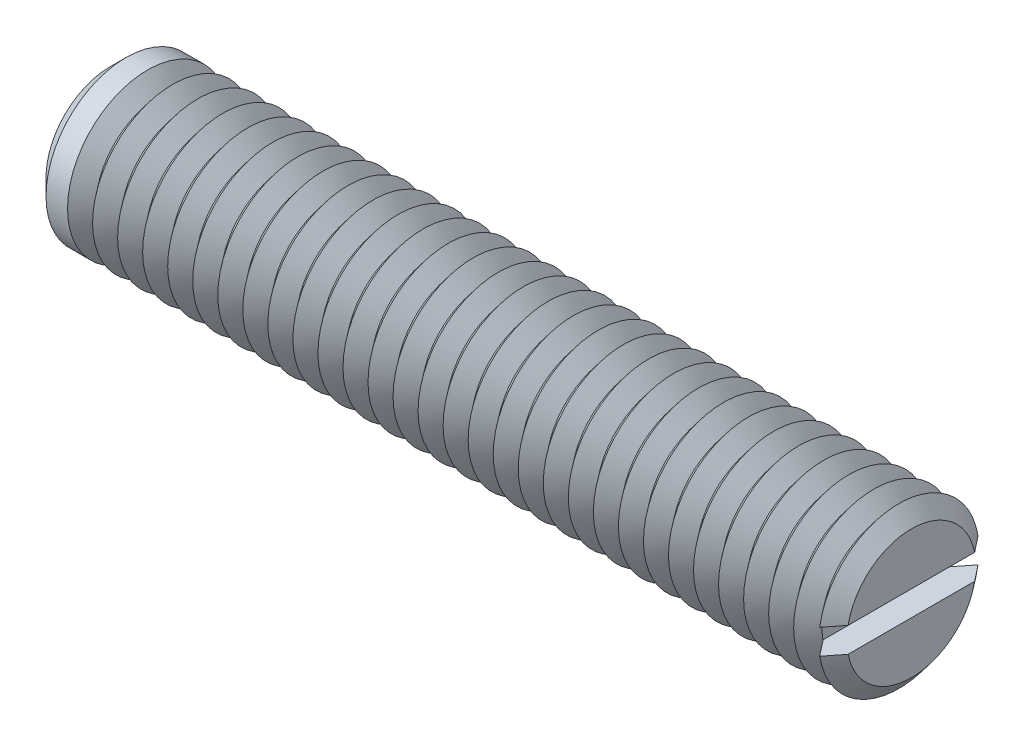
from build123d import *

# Parameters (mm, degrees)
SKETCH1_R       = 4
EXTRUDE1_DEPTH  = 20
SKETCH2_W       = 1.25
SKETCH2_H       = 1.25
EXTRUDE2_DEPTH  = 6
CHAMFER1_SIZE   = 0.8
LPATTERN1_COUNT = 31
LPATTERN1_PITCH = 1.25


with BuildPart() as part:
    # Sketch1 → Extrude1 (new, symmetric)
    with BuildSketch(Plane(origin=(0, 0, 0), x_dir=(0, 0, -1), z_dir=(1, 0, 0))):
        Circle(SKETCH1_R)
    extrude(amount=EXTRUDE1_DEPTH, both=True)

    # Sketch2 → Extrude2 (cut, symmetric)
    with BuildSketch(Plane.XY):
        with Locations((19.375, 0)):
            Rectangle(SKETCH2_W, SKETCH2_H)
    extrude(amount=EXTRUDE2_DEPTH, both=True, mode=Mode.SUBTRACT)

    # Chamfer1
    chamfer1_edges = [part.edges().sort_by_distance(p)[0] for p in [
        (-20, 0, 4),
    ]]
    chamfer(chamfer1_edges, length=CHAMFER1_SIZE)

    # Sketch3 → Cut-Revolve1 (revolve, cut)
    with BuildSketch(Plane.XY, mode=Mode.PRIVATE) as cut_revolve1_sk:
        Polygon((19.375, -4), (20.625, -4), (20, -3.21937525), align=None)
    cut_revolve1 = revolve(cut_revolve1_sk.sketch.rotate(Axis((0, 0, 0), (1, 0, 0)), 278.989299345), axis=Axis((0, 0, 0), (1, 0, 0)), mode=Mode.SUBTRACT)

    # LPattern1: Cut-Revolve1 ×31
    with Locations(*[(-i * LPATTERN1_PITCH, 0, 0) for i in range(1, LPATTERN1_COUNT)]):
        add(cut_revolve1, mode=Mode.SUBTRACT)


solid = part.part
